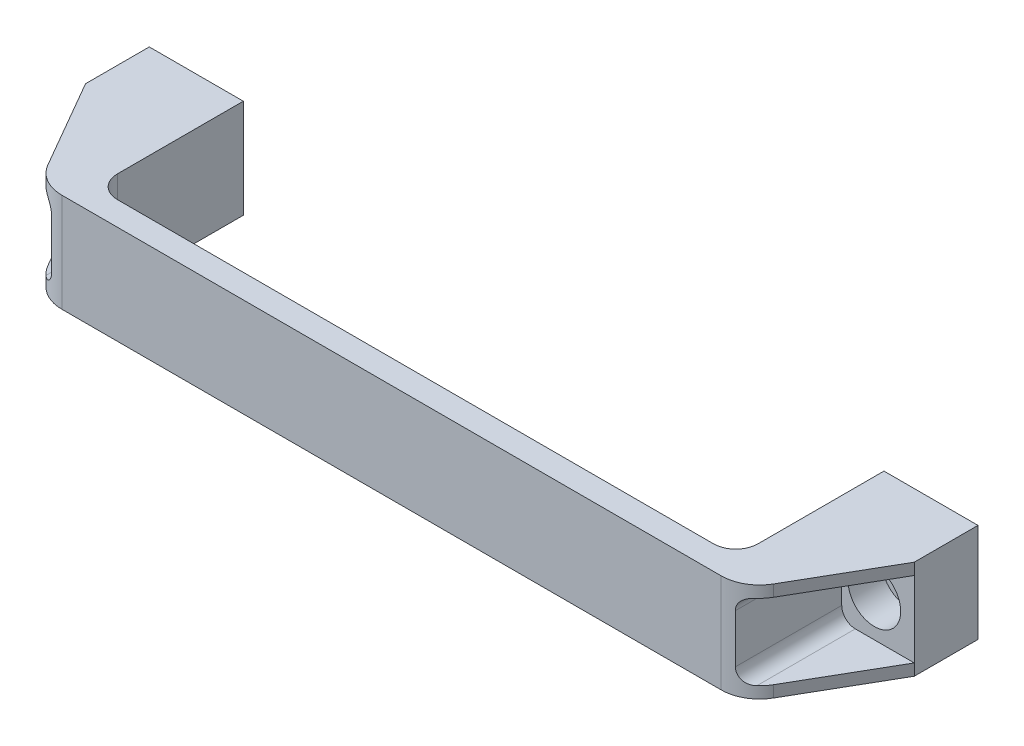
ISO-10303-21;
HEADER;
FILE_DESCRIPTION(('STEP AP214'),'2;1');
FILE_NAME('part.step','',(''),(''),'','','');
FILE_SCHEMA(('AUTOMOTIVE_DESIGN { 1 0 10303 214 1 1 1 1 }'));
ENDSEC;
DATA;
#1=APPLICATION_CONTEXT('core data for automotive mechanical design processes');
#2=APPLICATION_PROTOCOL_DEFINITION('international standard','automotive_design',2000,#1);
#3=PRODUCT_CONTEXT('',#1,'mechanical');
#4=PRODUCT('Part','Part','',(#3));
#5=PRODUCT_RELATED_PRODUCT_CATEGORY('part','',(#4));
#6=PRODUCT_DEFINITION_FORMATION('','',#4);
#7=PRODUCT_DEFINITION_CONTEXT('part definition',#1,'design');
#8=PRODUCT_DEFINITION('design','',#6,#7);
#9=PRODUCT_DEFINITION_SHAPE('','',#8);
#10=(LENGTH_UNIT() NAMED_UNIT(*) SI_UNIT(.MILLI.,.METRE.));
#11=(NAMED_UNIT(*) PLANE_ANGLE_UNIT() SI_UNIT($,.RADIAN.));
#12=(NAMED_UNIT(*) SI_UNIT($,.STERADIAN.) SOLID_ANGLE_UNIT());
#13=UNCERTAINTY_MEASURE_WITH_UNIT(LENGTH_MEASURE(1.E-05),#10,'distance_accuracy_value','');
#14=(GEOMETRIC_REPRESENTATION_CONTEXT(3) GLOBAL_UNCERTAINTY_ASSIGNED_CONTEXT((#13)) GLOBAL_UNIT_ASSIGNED_CONTEXT((#10,
#11,#12)) REPRESENTATION_CONTEXT('',''));
#15=CARTESIAN_POINT('',(0.,0.,0.));
#16=DIRECTION('',(0.,0.,1.));
#17=DIRECTION('',(1.,0.,0.));
#18=AXIS2_PLACEMENT_3D('',#15,#16,#17);
#19=CARTESIAN_POINT('',(0.,6.75,9.5));
#20=DIRECTION('',(0.,0.,-1.));
#21=DIRECTION('',(0.,1.,0.));
#22=AXIS2_PLACEMENT_3D('',#19,#20,#21);
#23=PLANE('',#22);
#24=CARTESIAN_POINT('',(0.,0.,9.5));
#25=DIRECTION('',(0.,0.,-1.));
#26=DIRECTION('',(0.,1.,0.));
#27=AXIS2_PLACEMENT_3D('',#24,#25,#26);
#28=CIRCLE('',#27,5.25);
#29=CARTESIAN_POINT('',(0.,5.25,9.5));
#30=VERTEX_POINT('',#29);
#31=EDGE_CURVE('E430',#30,#30,#28,.T.);
#32=ORIENTED_EDGE('',*,*,#31,.T.);
#33=EDGE_LOOP('',(#32));
#34=FACE_BOUND('',#33,.T.);
#35=CARTESIAN_POINT('',(0.,0.,9.5));
#36=DIRECTION('',(0.,0.,-1.));
#37=DIRECTION('',(0.,1.,0.));
#38=AXIS2_PLACEMENT_3D('',#35,#36,#37);
#39=CIRCLE('',#38,8.25);
#40=CARTESIAN_POINT('',(0.,8.25,9.5));
#41=VERTEX_POINT('',#40);
#42=EDGE_CURVE('E17',#41,#41,#39,.F.);
#43=ORIENTED_EDGE('',*,*,#42,.T.);
#44=EDGE_LOOP('',(#43));
#45=FACE_BOUND('',#44,.T.);
#46=ADVANCED_FACE('F14',(#34,#45),#23,.F.);
#47=CARTESIAN_POINT('',(235.,6.75,9.5));
#48=DIRECTION('',(0.,0.,-1.));
#49=DIRECTION('',(0.,1.,0.));
#50=AXIS2_PLACEMENT_3D('',#47,#48,#49);
#51=PLANE('',#50);
#52=CARTESIAN_POINT('',(235.,0.,9.5));
#53=DIRECTION('',(0.,0.,-1.));
#54=DIRECTION('',(0.,1.,0.));
#55=AXIS2_PLACEMENT_3D('',#52,#53,#54);
#56=CIRCLE('',#55,5.25);
#57=CARTESIAN_POINT('',(235.,5.25,9.5));
#58=VERTEX_POINT('',#57);
#59=EDGE_CURVE('E423',#58,#58,#56,.T.);
#60=ORIENTED_EDGE('',*,*,#59,.T.);
#61=EDGE_LOOP('',(#60));
#62=FACE_BOUND('',#61,.T.);
#63=CARTESIAN_POINT('',(235.,0.,9.5));
#64=DIRECTION('',(0.,0.,-1.));
#65=DIRECTION('',(0.,1.,0.));
#66=AXIS2_PLACEMENT_3D('',#63,#64,#65);
#67=CIRCLE('',#66,8.25);
#68=CARTESIAN_POINT('',(235.,8.25,9.5));
#69=VERTEX_POINT('',#68);
#70=EDGE_CURVE('E432',#69,#69,#67,.F.);
#71=ORIENTED_EDGE('',*,*,#70,.T.);
#72=EDGE_LOOP('',(#71));
#73=FACE_BOUND('',#72,.T.);
#74=ADVANCED_FACE('F443',(#62,#73),#51,.F.);
#75=CARTESIAN_POINT('',(0.,0.,14.75));
#76=DIRECTION('',(0.,0.,-1.));
#77=DIRECTION('',(0.,1.,0.));
#78=AXIS2_PLACEMENT_3D('',#75,#76,#77);
#79=CYLINDRICAL_SURFACE('',#78,8.25);
#80=CARTESIAN_POINT('',(0.,0.,20.));
#81=DIRECTION('',(0.,0.,-1.));
#82=DIRECTION('',(0.,1.,0.));
#83=AXIS2_PLACEMENT_3D('',#80,#81,#82);
#84=CIRCLE('',#83,8.25);
#85=CARTESIAN_POINT('',(0.,8.25,20.));
#86=VERTEX_POINT('',#85);
#87=EDGE_CURVE('E418',#86,#86,#84,.T.);
#88=ORIENTED_EDGE('',*,*,#87,.F.);
#89=EDGE_LOOP('',(#88));
#90=FACE_BOUND('',#89,.T.);
#91=ORIENTED_EDGE('',*,*,#42,.F.);
#92=EDGE_LOOP('',(#91));
#93=FACE_BOUND('',#92,.T.);
#94=ADVANCED_FACE('F440',(#90,#93),#79,.F.);
#95=CARTESIAN_POINT('',(235.,0.,14.75));
#96=DIRECTION('',(0.,0.,-1.));
#97=DIRECTION('',(0.,1.,0.));
#98=AXIS2_PLACEMENT_3D('',#95,#96,#97);
#99=CYLINDRICAL_SURFACE('',#98,8.25);
#100=CARTESIAN_POINT('',(235.,0.,20.));
#101=DIRECTION('',(0.,0.,-1.));
#102=DIRECTION('',(0.,1.,0.));
#103=AXIS2_PLACEMENT_3D('',#100,#101,#102);
#104=CIRCLE('',#103,8.25);
#105=CARTESIAN_POINT('',(235.,8.25,20.));
#106=VERTEX_POINT('',#105);
#107=EDGE_CURVE('E416',#106,#106,#104,.T.);
#108=ORIENTED_EDGE('',*,*,#107,.F.);
#109=EDGE_LOOP('',(#108));
#110=FACE_BOUND('',#109,.T.);
#111=ORIENTED_EDGE('',*,*,#70,.F.);
#112=EDGE_LOOP('',(#111));
#113=FACE_BOUND('',#112,.T.);
#114=ADVANCED_FACE('F442',(#110,#113),#99,.F.);
#115=CARTESIAN_POINT('',(0.,0.,4.75));
#116=DIRECTION('',(0.,0.,-1.));
#117=DIRECTION('',(0.,1.,0.));
#118=AXIS2_PLACEMENT_3D('',#115,#116,#117);
#119=CYLINDRICAL_SURFACE('',#118,5.25);
#120=CARTESIAN_POINT('',(0.,0.,0.));
#121=DIRECTION('',(0.,0.,-1.));
#122=DIRECTION('',(0.,1.,0.));
#123=AXIS2_PLACEMENT_3D('',#120,#121,#122);
#124=CIRCLE('',#123,5.25);
#125=CARTESIAN_POINT('',(0.,5.25,0.));
#126=VERTEX_POINT('',#125);
#127=EDGE_CURVE('E373',#126,#126,#124,.F.);
#128=ORIENTED_EDGE('',*,*,#127,.F.);
#129=EDGE_LOOP('',(#128));
#130=FACE_BOUND('',#129,.T.);
#131=ORIENTED_EDGE('',*,*,#31,.F.);
#132=EDGE_LOOP('',(#131));
#133=FACE_BOUND('',#132,.T.);
#134=ADVANCED_FACE('F450',(#130,#133),#119,.F.);
#135=CARTESIAN_POINT('',(235.,0.,4.75));
#136=DIRECTION('',(0.,0.,-1.));
#137=DIRECTION('',(0.,1.,0.));
#138=AXIS2_PLACEMENT_3D('',#135,#136,#137);
#139=CYLINDRICAL_SURFACE('',#138,5.25);
#140=CARTESIAN_POINT('',(235.,0.,0.));
#141=DIRECTION('',(0.,0.,-1.));
#142=DIRECTION('',(0.,1.,0.));
#143=AXIS2_PLACEMENT_3D('',#140,#141,#142);
#144=CIRCLE('',#143,5.25);
#145=CARTESIAN_POINT('',(235.,5.25,0.));
#146=VERTEX_POINT('',#145);
#147=EDGE_CURVE('E359',#146,#146,#144,.F.);
#148=ORIENTED_EDGE('',*,*,#147,.F.);
#149=EDGE_LOOP('',(#148));
#150=FACE_BOUND('',#149,.T.);
#151=ORIENTED_EDGE('',*,*,#59,.F.);
#152=EDGE_LOOP('',(#151));
#153=FACE_BOUND('',#152,.T.);
#154=ADVANCED_FACE('F458',(#150,#153),#139,.F.);
#155=CARTESIAN_POINT('',(117.5,0.,20.));
#156=DIRECTION('',(0.,0.,1.));
#157=DIRECTION('',(0.,-1.,0.));
#158=AXIS2_PLACEMENT_3D('',#155,#156,#157);
#159=PLANE('',#158);
#160=CARTESIAN_POINT('',(6.,7.625,20.));
#161=DIRECTION('',(0.,0.,-1.));
#162=DIRECTION('',(0.,1.,0.));
#163=AXIS2_PLACEMENT_3D('',#160,#161,#162);
#164=CIRCLE('',#163,4.25);
#165=CARTESIAN_POINT('',(10.25,7.625,20.));
#166=VERTEX_POINT('',#165);
#167=CARTESIAN_POINT('',(6.,11.875,20.));
#168=VERTEX_POINT('',#167);
#169=EDGE_CURVE('E142',#166,#168,#164,.F.);
#170=ORIENTED_EDGE('',*,*,#169,.T.);
#171=DIRECTION('',(-1.,0.,0.));
#172=VECTOR('',#171,1.);
#173=CARTESIAN_POINT('',(-14.5,11.875,20.));
#174=LINE('',#173,#172);
#175=CARTESIAN_POINT('',(-12.5,11.875,20.));
#176=VERTEX_POINT('',#175);
#177=EDGE_CURVE('E146',#168,#176,#174,.T.);
#178=ORIENTED_EDGE('',*,*,#177,.T.);
#179=DIRECTION('',(0.,-1.,0.));
#180=VECTOR('',#179,1.);
#181=CARTESIAN_POINT('',(-12.5,-15.5,20.));
#182=LINE('',#181,#180);
#183=CARTESIAN_POINT('',(-12.5,-11.875,20.));
#184=VERTEX_POINT('',#183);
#185=EDGE_CURVE('E338',#184,#176,#182,.F.);
#186=ORIENTED_EDGE('',*,*,#185,.F.);
#187=DIRECTION('',(1.,0.,0.));
#188=VECTOR('',#187,1.);
#189=CARTESIAN_POINT('',(6.,-11.875,20.));
#190=LINE('',#189,#188);
#191=CARTESIAN_POINT('',(6.,-11.875,20.));
#192=VERTEX_POINT('',#191);
#193=EDGE_CURVE('E415',#184,#192,#190,.T.);
#194=ORIENTED_EDGE('',*,*,#193,.T.);
#195=CARTESIAN_POINT('',(6.,-7.625,20.));
#196=DIRECTION('',(0.,0.,-1.));
#197=DIRECTION('',(0.,1.,0.));
#198=AXIS2_PLACEMENT_3D('',#195,#196,#197);
#199=CIRCLE('',#198,4.25);
#200=CARTESIAN_POINT('',(10.25,-7.625,20.));
#201=VERTEX_POINT('',#200);
#202=EDGE_CURVE('E380',#192,#201,#199,.F.);
#203=ORIENTED_EDGE('',*,*,#202,.T.);
#204=DIRECTION('',(0.,1.,0.));
#205=VECTOR('',#204,1.);
#206=CARTESIAN_POINT('',(10.25,7.625,20.));
#207=LINE('',#206,#205);
#208=EDGE_CURVE('E138',#201,#166,#207,.T.);
#209=ORIENTED_EDGE('',*,*,#208,.T.);
#210=EDGE_LOOP('',(#170,#178,#186,#194,#203,#209));
#211=FACE_BOUND('',#210,.T.);
#212=ORIENTED_EDGE('',*,*,#87,.T.);
#213=EDGE_LOOP('',(#212));
#214=FACE_BOUND('',#213,.T.);
#215=ADVANCED_FACE('F462',(#211,#214),#159,.T.);
#216=CARTESIAN_POINT('',(117.5,0.,20.));
#217=DIRECTION('',(0.,0.,1.));
#218=DIRECTION('',(0.,-1.,0.));
#219=AXIS2_PLACEMENT_3D('',#216,#217,#218);
#220=PLANE('',#219);
#221=CARTESIAN_POINT('',(229.,-7.625,20.));
#222=DIRECTION('',(0.,0.,-1.));
#223=DIRECTION('',(0.,1.,0.));
#224=AXIS2_PLACEMENT_3D('',#221,#222,#223);
#225=CIRCLE('',#224,4.25);
#226=CARTESIAN_POINT('',(224.75,-7.625,20.));
#227=VERTEX_POINT('',#226);
#228=CARTESIAN_POINT('',(229.,-11.875,20.));
#229=VERTEX_POINT('',#228);
#230=EDGE_CURVE('E180',#227,#229,#225,.F.);
#231=ORIENTED_EDGE('',*,*,#230,.T.);
#232=DIRECTION('',(1.,0.,0.));
#233=VECTOR('',#232,1.);
#234=CARTESIAN_POINT('',(249.5,-11.875,20.));
#235=LINE('',#234,#233);
#236=CARTESIAN_POINT('',(247.5,-11.875,20.));
#237=VERTEX_POINT('',#236);
#238=EDGE_CURVE('E176',#229,#237,#235,.T.);
#239=ORIENTED_EDGE('',*,*,#238,.T.);
#240=DIRECTION('',(0.,1.,0.));
#241=VECTOR('',#240,1.);
#242=CARTESIAN_POINT('',(247.5,-15.5,20.));
#243=LINE('',#242,#241);
#244=CARTESIAN_POINT('',(247.5,11.875,20.));
#245=VERTEX_POINT('',#244);
#246=EDGE_CURVE('E353',#245,#237,#243,.F.);
#247=ORIENTED_EDGE('',*,*,#246,.F.);
#248=DIRECTION('',(-1.,0.,0.));
#249=VECTOR('',#248,1.);
#250=CARTESIAN_POINT('',(229.,11.875,20.));
#251=LINE('',#250,#249);
#252=CARTESIAN_POINT('',(229.,11.875,20.));
#253=VERTEX_POINT('',#252);
#254=EDGE_CURVE('E332',#245,#253,#251,.T.);
#255=ORIENTED_EDGE('',*,*,#254,.T.);
#256=CARTESIAN_POINT('',(229.,7.625,20.));
#257=DIRECTION('',(0.,0.,-1.));
#258=DIRECTION('',(0.,1.,0.));
#259=AXIS2_PLACEMENT_3D('',#256,#257,#258);
#260=CIRCLE('',#259,4.25);
#261=CARTESIAN_POINT('',(224.75,7.625,20.));
#262=VERTEX_POINT('',#261);
#263=EDGE_CURVE('E320',#253,#262,#260,.F.);
#264=ORIENTED_EDGE('',*,*,#263,.T.);
#265=DIRECTION('',(0.,-1.,0.));
#266=VECTOR('',#265,1.);
#267=CARTESIAN_POINT('',(224.75,-7.625,20.));
#268=LINE('',#267,#266);
#269=EDGE_CURVE('E179',#262,#227,#268,.T.);
#270=ORIENTED_EDGE('',*,*,#269,.T.);
#271=EDGE_LOOP('',(#231,#239,#247,#255,#264,#270));
#272=FACE_BOUND('',#271,.T.);
#273=ORIENTED_EDGE('',*,*,#107,.T.);
#274=EDGE_LOOP('',(#273));
#275=FACE_BOUND('',#274,.T.);
#276=ADVANCED_FACE('F466',(#272,#275),#220,.T.);
#277=CARTESIAN_POINT('',(6.,-11.875,20.));
#278=DIRECTION('',(0.,-1.,0.));
#279=DIRECTION('',(1.,0.,0.));
#280=AXIS2_PLACEMENT_3D('',#277,#278,#279);
#281=PLANE('',#280);
#282=DIRECTION('',(0.,0.,-1.));
#283=VECTOR('',#282,1.);
#284=CARTESIAN_POINT('',(6.,-11.875,20.));
#285=LINE('',#284,#283);
#286=CARTESIAN_POINT('',(6.,-11.875,50.8919528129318));
#287=VERTEX_POINT('',#286);
#288=EDGE_CURVE('E381',#287,#192,#285,.T.);
#289=ORIENTED_EDGE('',*,*,#288,.T.);
#290=ORIENTED_EDGE('',*,*,#193,.F.);
#291=DIRECTION('',(-0.5,0.,-0.866025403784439));
#292=VECTOR('',#291,1.);
#293=CARTESIAN_POINT('',(3.66580753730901,-11.875,48.));
#294=LINE('',#293,#292);
#295=CARTESIAN_POINT('',(3.66580753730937,-11.875,48.));
#296=VERTEX_POINT('',#295);
#297=EDGE_CURVE('E352',#296,#184,#294,.T.);
#298=ORIENTED_EDGE('',*,*,#297,.F.);
#299=CARTESIAN_POINT('',(14.058112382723,-11.875,42.));
#300=DIRECTION('',(0.,-1.,0.));
#301=DIRECTION('',(1.,0.,0.));
#302=AXIS2_PLACEMENT_3D('',#299,#300,#301);
#303=CIRCLE('',#302,12.);
#304=EDGE_CURVE('E301',#287,#296,#303,.T.);
#305=ORIENTED_EDGE('',*,*,#304,.F.);
#306=EDGE_LOOP('',(#289,#290,#298,#305));
#307=FACE_BOUND('',#306,.T.);
#308=ADVANCED_FACE('F469',(#307),#281,.F.);
#309=CARTESIAN_POINT('',(3.66580753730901,-15.5,48.));
#310=DIRECTION('',(-0.866025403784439,0.,0.5));
#311=DIRECTION('',(-0.5,0.,-0.866025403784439));
#312=AXIS2_PLACEMENT_3D('',#309,#310,#311);
#313=PLANE('',#312);
#314=DIRECTION('',(-0.499999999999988,0.,-0.866025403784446));
#315=VECTOR('',#314,1.);
#316=CARTESIAN_POINT('',(3.66580753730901,15.5,48.));
#317=LINE('',#316,#315);
#318=CARTESIAN_POINT('',(3.66580753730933,15.5,48.));
#319=VERTEX_POINT('',#318);
#320=CARTESIAN_POINT('',(-12.5,15.5,20.));
#321=VERTEX_POINT('',#320);
#322=EDGE_CURVE('E303',#319,#321,#317,.T.);
#323=ORIENTED_EDGE('',*,*,#322,.T.);
#324=DIRECTION('',(0.,-1.,0.));
#325=VECTOR('',#324,1.);
#326=CARTESIAN_POINT('',(-12.5,-15.5,20.));
#327=LINE('',#326,#325);
#328=EDGE_CURVE('E400',#176,#321,#327,.F.);
#329=ORIENTED_EDGE('',*,*,#328,.F.);
#330=DIRECTION('',(0.499999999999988,0.,0.866025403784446));
#331=VECTOR('',#330,1.);
#332=CARTESIAN_POINT('',(-12.5,11.875,20.));
#333=LINE('',#332,#331);
#334=CARTESIAN_POINT('',(3.66580753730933,11.875,48.));
#335=VERTEX_POINT('',#334);
#336=EDGE_CURVE('E388',#176,#335,#333,.T.);
#337=ORIENTED_EDGE('',*,*,#336,.T.);
#338=DIRECTION('',(0.,-1.,0.));
#339=VECTOR('',#338,1.);
#340=CARTESIAN_POINT('',(3.66580753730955,-15.5,48.));
#341=LINE('',#340,#339);
#342=EDGE_CURVE('E390',#319,#335,#341,.T.);
#343=ORIENTED_EDGE('',*,*,#342,.F.);
#344=EDGE_LOOP('',(#323,#329,#337,#343));
#345=FACE_BOUND('',#344,.T.);
#346=ADVANCED_FACE('F473',(#345),#313,.T.);
#347=CARTESIAN_POINT('',(-14.5,11.875,20.));
#348=DIRECTION('',(0.,1.,0.));
#349=DIRECTION('',(-1.,0.,0.));
#350=AXIS2_PLACEMENT_3D('',#347,#348,#349);
#351=PLANE('',#350);
#352=ORIENTED_EDGE('',*,*,#177,.F.);
#353=DIRECTION('',(0.,0.,-1.));
#354=VECTOR('',#353,1.);
#355=CARTESIAN_POINT('',(6.,11.875,20.));
#356=LINE('',#355,#354);
#357=CARTESIAN_POINT('',(6.,11.875,50.8919528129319));
#358=VERTEX_POINT('',#357);
#359=EDGE_CURVE('E386',#168,#358,#356,.F.);
#360=ORIENTED_EDGE('',*,*,#359,.T.);
#361=CARTESIAN_POINT('',(14.058112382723,11.875,42.));
#362=DIRECTION('',(0.,-1.,0.));
#363=DIRECTION('',(1.,0.,0.));
#364=AXIS2_PLACEMENT_3D('',#361,#362,#363);
#365=CIRCLE('',#364,12.);
#366=EDGE_CURVE('E393',#335,#358,#365,.F.);
#367=ORIENTED_EDGE('',*,*,#366,.F.);
#368=ORIENTED_EDGE('',*,*,#336,.F.);
#369=EDGE_LOOP('',(#352,#360,#367,#368));
#370=FACE_BOUND('',#369,.T.);
#371=ADVANCED_FACE('F477',(#370),#351,.F.);
#372=CARTESIAN_POINT('',(6.,7.625,20.));
#373=DIRECTION('',(0.,0.,-1.));
#374=DIRECTION('',(0.,1.,0.));
#375=AXIS2_PLACEMENT_3D('',#372,#373,#374);
#376=CYLINDRICAL_SURFACE('',#375,4.25);
#377=ORIENTED_EDGE('',*,*,#359,.F.);
#378=ORIENTED_EDGE('',*,*,#169,.F.);
#379=DIRECTION('',(0.,0.,1.));
#380=VECTOR('',#379,1.);
#381=CARTESIAN_POINT('',(10.25,7.625,20.));
#382=LINE('',#381,#380);
#383=CARTESIAN_POINT('',(10.25,7.625,53.3797311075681));
#384=VERTEX_POINT('',#383);
#385=EDGE_CURVE('E384',#166,#384,#382,.T.);
#386=ORIENTED_EDGE('',*,*,#385,.T.);
#387=CARTESIAN_POINT('',(6.00000000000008,11.875,50.8919528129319));
#388=CARTESIAN_POINT('',(6.13384738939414,11.8750073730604,51.0133113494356));
#389=CARTESIAN_POINT('',(6.27059676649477,11.8686731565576,51.1316698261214));
#390=CARTESIAN_POINT('',(6.54878581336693,11.8417412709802,51.3617511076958));
#391=CARTESIAN_POINT('',(6.69023670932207,11.8211067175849,51.4734559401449));
#392=CARTESIAN_POINT('',(6.97658654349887,11.7638618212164,51.6893934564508));
#393=CARTESIAN_POINT('',(7.12149714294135,11.72718699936,51.793593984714));
#394=CARTESIAN_POINT('',(7.41192284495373,11.636491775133,51.992952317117));
#395=CARTESIAN_POINT('',(7.55743696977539,11.5824930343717,52.0881212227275));
#396=CARTESIAN_POINT('',(7.79995949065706,11.4765054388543,52.2395758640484));
#397=CARTESIAN_POINT('',(7.89749898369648,11.429468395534,52.2985143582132));
#398=CARTESIAN_POINT('',(8.09075045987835,11.3267867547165,52.4116815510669));
#399=CARTESIAN_POINT('',(8.18646289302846,11.271144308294,52.4659114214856));
#400=CARTESIAN_POINT('',(8.3748018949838,11.1513631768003,52.5693660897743));
#401=CARTESIAN_POINT('',(8.46743617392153,11.0872480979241,52.6186041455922));
#402=CARTESIAN_POINT('',(8.64880410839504,10.9505413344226,52.7121328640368));
#403=CARTESIAN_POINT('',(8.73753947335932,10.8779534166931,52.7564257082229));
#404=CARTESIAN_POINT('',(8.91053657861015,10.7241515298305,52.8402838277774));
#405=CARTESIAN_POINT('',(8.99477309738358,10.6428953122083,52.8798237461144));
#406=CARTESIAN_POINT('',(9.15720204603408,10.4725289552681,52.9539512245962));
#407=CARTESIAN_POINT('',(9.23539682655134,10.3834218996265,52.9885407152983));
#408=CARTESIAN_POINT('',(9.38488711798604,10.1977918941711,53.0529453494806));
#409=CARTESIAN_POINT('',(9.45617411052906,10.1012600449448,53.0827546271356));
#410=CARTESIAN_POINT('',(9.59084163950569,9.90158847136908,53.1377189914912));
#411=CARTESIAN_POINT('',(9.65422275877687,9.79844923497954,53.1628744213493));
#412=CARTESIAN_POINT('',(9.76840793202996,9.59336402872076,53.2072270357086));
#413=CARTESIAN_POINT('',(9.81976536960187,9.49178677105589,53.2267075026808));
#414=CARTESIAN_POINT('',(9.91435934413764,9.28430382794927,53.2619651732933));
#415=CARTESIAN_POINT('',(9.95759625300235,9.17839834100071,53.2777425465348));
#416=CARTESIAN_POINT('',(10.0354674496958,8.96312939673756,53.3057526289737));
#417=CARTESIAN_POINT('',(10.0701097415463,8.85376926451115,53.3179886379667));
#418=CARTESIAN_POINT('',(10.1304890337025,8.6323389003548,53.3390823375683));
#419=CARTESIAN_POINT('',(10.1562286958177,8.52026948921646,53.3479410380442));
#420=CARTESIAN_POINT('',(10.2015095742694,8.27842770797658,53.3634197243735));
#421=CARTESIAN_POINT('',(10.2196855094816,8.14836636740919,53.3695551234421));
#422=CARTESIAN_POINT('',(10.2439357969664,7.88719980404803,53.3777009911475));
#423=CARTESIAN_POINT('',(10.2500291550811,7.75609654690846,53.3797179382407));
#424=CARTESIAN_POINT('',(10.25,7.625,53.379731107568));
#425=B_SPLINE_CURVE_WITH_KNOTS('',3,(#387,#388,#389,#390,#391,#392,#393,#394,#395,#396,#397,
#398,#399,#400,#401,#402,#403,#404,#405,#406,#407,#408,#409,#410,#411,#412,#413,#414,#415,#416,
#417,#418,#419,#420,#421,#422,#423,#424),.UNSPECIFIED.,.F.,.F.,(4,2,2,2,2,2,2,2,2,2,2,2,2,2,2,2,
2,2,4),(0.,0.54206845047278,1.08554026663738,1.6312171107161,2.17621428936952,2.5457192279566,
2.91513195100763,3.28353631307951,3.65177750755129,4.02190344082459,4.39188463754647,
4.76231642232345,5.13272088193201,5.47873258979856,5.82472844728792,6.17040086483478,
6.51596983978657,6.90973787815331,7.30288602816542),.UNSPECIFIED.);
#426=EDGE_CURVE('E238',#358,#384,#425,.T.);
#427=ORIENTED_EDGE('',*,*,#426,.F.);
#428=EDGE_LOOP('',(#377,#378,#386,#427));
#429=FACE_BOUND('',#428,.T.);
#430=ADVANCED_FACE('F480',(#429),#376,.F.);
#431=CARTESIAN_POINT('',(10.25,7.625,20.));
#432=DIRECTION('',(1.,0.,0.));
#433=DIRECTION('',(0.,1.,0.));
#434=AXIS2_PLACEMENT_3D('',#431,#432,#433);
#435=PLANE('',#434);
#436=ORIENTED_EDGE('',*,*,#385,.F.);
#437=ORIENTED_EDGE('',*,*,#208,.F.);
#438=DIRECTION('',(0.,0.,-1.));
#439=VECTOR('',#438,1.);
#440=CARTESIAN_POINT('',(10.25,-7.625,20.));
#441=LINE('',#440,#439);
#442=CARTESIAN_POINT('',(10.25,-7.625,53.3797311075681));
#443=VERTEX_POINT('',#442);
#444=EDGE_CURVE('E378',#201,#443,#441,.F.);
#445=ORIENTED_EDGE('',*,*,#444,.T.);
#446=DIRECTION('',(0.,-1.,0.));
#447=VECTOR('',#446,1.);
#448=CARTESIAN_POINT('',(10.25,-15.5,53.3797311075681));
#449=LINE('',#448,#447);
#450=EDGE_CURVE('E237',#384,#443,#449,.T.);
#451=ORIENTED_EDGE('',*,*,#450,.F.);
#452=EDGE_LOOP('',(#436,#437,#445,#451));
#453=FACE_BOUND('',#452,.T.);
#454=ADVANCED_FACE('F484',(#453),#435,.F.);
#455=CARTESIAN_POINT('',(6.,-7.625,20.));
#456=DIRECTION('',(0.,0.,-1.));
#457=DIRECTION('',(0.,1.,0.));
#458=AXIS2_PLACEMENT_3D('',#455,#456,#457);
#459=CYLINDRICAL_SURFACE('',#458,4.25);
#460=ORIENTED_EDGE('',*,*,#444,.F.);
#461=ORIENTED_EDGE('',*,*,#202,.F.);
#462=ORIENTED_EDGE('',*,*,#288,.F.);
#463=CARTESIAN_POINT('',(10.25,-7.625,53.379731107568));
#464=CARTESIAN_POINT('',(10.2500152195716,-7.73839038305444,53.3797234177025));
#465=CARTESIAN_POINT('',(10.2454627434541,-7.85177923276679,53.3782123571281));
#466=CARTESIAN_POINT('',(10.2273317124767,-8.07774568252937,53.3721277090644));
#467=CARTESIAN_POINT('',(10.2137535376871,-8.19032331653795,53.367554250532));
#468=CARTESIAN_POINT('',(10.1776958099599,-8.41377337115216,53.3552942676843));
#469=CARTESIAN_POINT('',(10.1552238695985,-8.52464716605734,53.3476104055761));
#470=CARTESIAN_POINT('',(10.101596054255,-8.74399711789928,53.3290241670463));
#471=CARTESIAN_POINT('',(10.0704403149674,-8.85247331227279,53.3181218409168));
#472=CARTESIAN_POINT('',(9.99972993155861,-9.06630022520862,53.2929596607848));
#473=CARTESIAN_POINT('',(9.9601720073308,-9.17164970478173,53.2786984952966));
#474=CARTESIAN_POINT('',(9.87303929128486,-9.37847161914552,53.2466580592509));
#475=CARTESIAN_POINT('',(9.8254615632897,-9.47994261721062,53.2288774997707));
#476=CARTESIAN_POINT('',(9.72281679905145,-9.6781891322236,53.1896481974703));
#477=CARTESIAN_POINT('',(9.66775505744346,-9.77496790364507,53.1682020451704));
#478=CARTESIAN_POINT('',(9.5506638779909,-9.96328655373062,53.1214603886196));
#479=CARTESIAN_POINT('',(9.48863188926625,-10.0548244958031,53.0961634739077));
#480=CARTESIAN_POINT('',(9.35821385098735,-10.2321094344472,53.0415557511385));
#481=CARTESIAN_POINT('',(9.28982250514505,-10.3178514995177,53.0122415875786));
#482=CARTESIAN_POINT('',(9.14743093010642,-10.4829834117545,52.949486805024));
#483=CARTESIAN_POINT('',(9.07342868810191,-10.5623709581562,52.916044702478));
#484=CARTESIAN_POINT('',(8.92064291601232,-10.7143284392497,52.8449758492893));
#485=CARTESIAN_POINT('',(8.84186075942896,-10.7869003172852,52.8073502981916));
#486=CARTESIAN_POINT('',(8.68028912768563,-10.9249771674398,52.7278668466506));
#487=CARTESIAN_POINT('',(8.59749816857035,-10.9904794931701,52.6860073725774));
#488=CARTESIAN_POINT('',(8.42639249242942,-11.1159431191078,52.59685264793));
#489=CARTESIAN_POINT('',(8.3379879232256,-11.1756969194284,52.5494376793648));
#490=CARTESIAN_POINT('',(8.1587339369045,-11.2874502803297,52.4502564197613));
#491=CARTESIAN_POINT('',(8.06788363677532,-11.3394469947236,52.3984885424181));
#492=CARTESIAN_POINT('',(7.79296333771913,-11.4838273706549,52.2368406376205));
#493=CARTESIAN_POINT('',(7.60644498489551,-11.5646580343,52.1205758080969));
#494=CARTESIAN_POINT('',(7.21470690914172,-11.7035408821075,51.8604540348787));
#495=CARTESIAN_POINT('',(7.00948224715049,-11.7585068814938,51.7150005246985));
#496=CARTESIAN_POINT('',(6.60509436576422,-11.8367398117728,51.4083412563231));
#497=CARTESIAN_POINT('',(6.40592825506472,-11.8600221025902,51.2471431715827));
#498=CARTESIAN_POINT('',(6.17628204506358,-11.8714933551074,51.0487015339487));
#499=CARTESIAN_POINT('',(6.14074838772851,-11.8728162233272,51.0176264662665));
#500=CARTESIAN_POINT('',(6.07008379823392,-11.8745686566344,50.9550886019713));
#501=CARTESIAN_POINT('',(6.03495240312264,-11.8749993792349,50.9236263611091));
#502=CARTESIAN_POINT('',(6.00000000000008,-11.875,50.8919528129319));
#503=B_SPLINE_CURVE_WITH_KNOTS('',3,(#463,#464,#465,#466,#467,#468,#469,#470,#471,#472,#473,
#474,#475,#476,#477,#478,#479,#480,#481,#482,#483,#484,#485,#486,#487,#488,#489,#490,#491,#492,
#493,#494,#495,#496,#497,#498,#499,#500,#501,#502),.UNSPECIFIED.,.F.,.F.,(4,2,2,2,2,2,2,2,2,2,2,
2,2,2,2,2,2,2,2,4),(0.,0.340067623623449,0.680120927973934,1.01988379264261,1.35964134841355,
1.699531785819,2.0395469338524,2.37932277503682,2.71922337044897,3.05940962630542,
3.39971850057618,3.73993004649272,4.0802685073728,4.43017327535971,4.78020611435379,
5.47995915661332,6.24968804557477,7.01904364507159,7.16071198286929,7.30219639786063),.UNSPECIFIED.);
#504=EDGE_CURVE('E227',#443,#287,#503,.T.);
#505=ORIENTED_EDGE('',*,*,#504,.F.);
#506=EDGE_LOOP('',(#460,#461,#462,#505));
#507=FACE_BOUND('',#506,.T.);
#508=ADVANCED_FACE('F245',(#507),#459,.F.);
#509=CARTESIAN_POINT('',(-12.5,-15.5,0.));
#510=DIRECTION('',(0.,0.,-1.));
#511=DIRECTION('',(0.,1.,0.));
#512=AXIS2_PLACEMENT_3D('',#509,#510,#511);
#513=PLANE('',#512);
#514=DIRECTION('',(1.,0.,0.));
#515=VECTOR('',#514,1.);
#516=CARTESIAN_POINT('',(117.5,-15.5,0.));
#517=LINE('',#516,#515);
#518=CARTESIAN_POINT('',(-12.5,-15.5,0.));
#519=VERTEX_POINT('',#518);
#520=CARTESIAN_POINT('',(17.,-15.5,0.));
#521=VERTEX_POINT('',#520);
#522=EDGE_CURVE('E236',#519,#521,#517,.T.);
#523=ORIENTED_EDGE('',*,*,#522,.F.);
#524=DIRECTION('',(0.,-1.,0.));
#525=VECTOR('',#524,1.);
#526=CARTESIAN_POINT('',(-12.5,-15.5,0.));
#527=LINE('',#526,#525);
#528=CARTESIAN_POINT('',(-12.5,15.5,0.));
#529=VERTEX_POINT('',#528);
#530=EDGE_CURVE('E339',#529,#519,#527,.T.);
#531=ORIENTED_EDGE('',*,*,#530,.F.);
#532=DIRECTION('',(1.,0.,0.));
#533=VECTOR('',#532,1.);
#534=CARTESIAN_POINT('',(117.5,15.5,0.));
#535=LINE('',#534,#533);
#536=CARTESIAN_POINT('',(17.,15.5,0.));
#537=VERTEX_POINT('',#536);
#538=EDGE_CURVE('E302',#529,#537,#535,.T.);
#539=ORIENTED_EDGE('',*,*,#538,.T.);
#540=DIRECTION('',(0.,1.,0.));
#541=VECTOR('',#540,1.);
#542=CARTESIAN_POINT('',(17.,-15.5,0.));
#543=LINE('',#542,#541);
#544=EDGE_CURVE('E370',#521,#537,#543,.T.);
#545=ORIENTED_EDGE('',*,*,#544,.F.);
#546=EDGE_LOOP('',(#523,#531,#539,#545));
#547=FACE_BOUND('',#546,.T.);
#548=ORIENTED_EDGE('',*,*,#127,.T.);
#549=EDGE_LOOP('',(#548));
#550=FACE_BOUND('',#549,.T.);
#551=ADVANCED_FACE('F491',(#547,#550),#513,.T.);
#552=CARTESIAN_POINT('',(17.,-15.5,0.));
#553=DIRECTION('',(1.,0.,0.));
#554=DIRECTION('',(0.,1.,0.));
#555=AXIS2_PLACEMENT_3D('',#552,#553,#554);
#556=PLANE('',#555);
#557=DIRECTION('',(0.,0.,1.));
#558=VECTOR('',#557,1.);
#559=CARTESIAN_POINT('',(17.,-15.5,0.));
#560=LINE('',#559,#558);
#561=CARTESIAN_POINT('',(17.,-15.5,39.5));
#562=VERTEX_POINT('',#561);
#563=EDGE_CURVE('E226',#521,#562,#560,.T.);
#564=ORIENTED_EDGE('',*,*,#563,.F.);
#565=ORIENTED_EDGE('',*,*,#544,.T.);
#566=DIRECTION('',(0.,0.,1.));
#567=VECTOR('',#566,1.);
#568=CARTESIAN_POINT('',(17.,15.5,0.));
#569=LINE('',#568,#567);
#570=CARTESIAN_POINT('',(17.,15.5,39.5));
#571=VERTEX_POINT('',#570);
#572=EDGE_CURVE('E298',#537,#571,#569,.T.);
#573=ORIENTED_EDGE('',*,*,#572,.T.);
#574=DIRECTION('',(0.,-1.,0.));
#575=VECTOR('',#574,1.);
#576=CARTESIAN_POINT('',(17.,-15.5,39.5));
#577=LINE('',#576,#575);
#578=EDGE_CURVE('E368',#571,#562,#577,.T.);
#579=ORIENTED_EDGE('',*,*,#578,.T.);
#580=EDGE_LOOP('',(#564,#565,#573,#579));
#581=FACE_BOUND('',#580,.T.);
#582=ADVANCED_FACE('F523',(#581),#556,.T.);
#583=CARTESIAN_POINT('',(24.,-15.5,39.5));
#584=DIRECTION('',(0.,-1.,0.));
#585=DIRECTION('',(1.,0.,0.));
#586=AXIS2_PLACEMENT_3D('',#583,#584,#585);
#587=CYLINDRICAL_SURFACE('',#586,7.);
#588=DIRECTION('',(0.,1.,0.));
#589=VECTOR('',#588,1.);
#590=CARTESIAN_POINT('',(24.,-15.5,46.5));
#591=LINE('',#590,#589);
#592=CARTESIAN_POINT('',(24.,-15.5,46.5));
#593=VERTEX_POINT('',#592);
#594=CARTESIAN_POINT('',(24.,15.5,46.5));
#595=VERTEX_POINT('',#594);
#596=EDGE_CURVE('E365',#593,#595,#591,.T.);
#597=ORIENTED_EDGE('',*,*,#596,.F.);
#598=CARTESIAN_POINT('',(24.,-15.5,39.5));
#599=DIRECTION('',(0.,-1.,0.));
#600=DIRECTION('',(1.,0.,0.));
#601=AXIS2_PLACEMENT_3D('',#598,#599,#600);
#602=CIRCLE('',#601,7.);
#603=EDGE_CURVE('E223',#562,#593,#602,.F.);
#604=ORIENTED_EDGE('',*,*,#603,.F.);
#605=ORIENTED_EDGE('',*,*,#578,.F.);
#606=CARTESIAN_POINT('',(24.,15.5,39.5));
#607=DIRECTION('',(0.,-1.,0.));
#608=DIRECTION('',(1.,0.,0.));
#609=AXIS2_PLACEMENT_3D('',#606,#607,#608);
#610=CIRCLE('',#609,7.);
#611=EDGE_CURVE('E317',#571,#595,#610,.F.);
#612=ORIENTED_EDGE('',*,*,#611,.T.);
#613=EDGE_LOOP('',(#597,#604,#605,#612));
#614=FACE_BOUND('',#613,.T.);
#615=ADVANCED_FACE('F596',(#614),#587,.F.);
#616=CARTESIAN_POINT('',(24.,-15.5,46.5));
#617=DIRECTION('',(0.,0.,-1.));
#618=DIRECTION('',(0.,1.,0.));
#619=AXIS2_PLACEMENT_3D('',#616,#617,#618);
#620=PLANE('',#619);
#621=DIRECTION('',(1.,0.,0.));
#622=VECTOR('',#621,1.);
#623=CARTESIAN_POINT('',(117.5,-15.5,46.5));
#624=LINE('',#623,#622);
#625=CARTESIAN_POINT('',(211.,-15.5,46.5));
#626=VERTEX_POINT('',#625);
#627=EDGE_CURVE('E222',#593,#626,#624,.T.);
#628=ORIENTED_EDGE('',*,*,#627,.F.);
#629=ORIENTED_EDGE('',*,*,#596,.T.);
#630=DIRECTION('',(1.,0.,0.));
#631=VECTOR('',#630,1.);
#632=CARTESIAN_POINT('',(117.5,15.5,46.5));
#633=LINE('',#632,#631);
#634=CARTESIAN_POINT('',(211.,15.5,46.5));
#635=VERTEX_POINT('',#634);
#636=EDGE_CURVE('E315',#595,#635,#633,.T.);
#637=ORIENTED_EDGE('',*,*,#636,.T.);
#638=DIRECTION('',(0.,-1.,0.));
#639=VECTOR('',#638,1.);
#640=CARTESIAN_POINT('',(211.,-15.5,46.5));
#641=LINE('',#640,#639);
#642=EDGE_CURVE('E363',#635,#626,#641,.T.);
#643=ORIENTED_EDGE('',*,*,#642,.T.);
#644=EDGE_LOOP('',(#628,#629,#637,#643));
#645=FACE_BOUND('',#644,.T.);
#646=ADVANCED_FACE('F544',(#645),#620,.T.);
#647=CARTESIAN_POINT('',(211.,-15.5,39.5));
#648=DIRECTION('',(0.,-1.,0.));
#649=DIRECTION('',(1.,0.,0.));
#650=AXIS2_PLACEMENT_3D('',#647,#648,#649);
#651=CYLINDRICAL_SURFACE('',#650,7.);
#652=DIRECTION('',(0.,-1.,0.));
#653=VECTOR('',#652,1.);
#654=CARTESIAN_POINT('',(218.,-15.5,39.5));
#655=LINE('',#654,#653);
#656=CARTESIAN_POINT('',(218.,-15.5,39.5));
#657=VERTEX_POINT('',#656);
#658=CARTESIAN_POINT('',(218.,15.5,39.5));
#659=VERTEX_POINT('',#658);
#660=EDGE_CURVE('E360',#657,#659,#655,.F.);
#661=ORIENTED_EDGE('',*,*,#660,.F.);
#662=CARTESIAN_POINT('',(211.,-15.5,39.5));
#663=DIRECTION('',(0.,-1.,0.));
#664=DIRECTION('',(1.,0.,0.));
#665=AXIS2_PLACEMENT_3D('',#662,#663,#664);
#666=CIRCLE('',#665,7.);
#667=EDGE_CURVE('E218',#626,#657,#666,.F.);
#668=ORIENTED_EDGE('',*,*,#667,.F.);
#669=ORIENTED_EDGE('',*,*,#642,.F.);
#670=CARTESIAN_POINT('',(211.,15.5,39.5));
#671=DIRECTION('',(0.,-1.,0.));
#672=DIRECTION('',(1.,0.,0.));
#673=AXIS2_PLACEMENT_3D('',#670,#671,#672);
#674=CIRCLE('',#673,7.);
#675=EDGE_CURVE('E314',#635,#659,#674,.F.);
#676=ORIENTED_EDGE('',*,*,#675,.T.);
#677=EDGE_LOOP('',(#661,#668,#669,#676));
#678=FACE_BOUND('',#677,.T.);
#679=ADVANCED_FACE('F549',(#678),#651,.F.);
#680=CARTESIAN_POINT('',(218.,-15.5,39.5));
#681=DIRECTION('',(-1.,0.,0.));
#682=DIRECTION('',(0.,-1.,0.));
#683=AXIS2_PLACEMENT_3D('',#680,#681,#682);
#684=PLANE('',#683);
#685=DIRECTION('',(0.,0.,1.));
#686=VECTOR('',#685,1.);
#687=CARTESIAN_POINT('',(218.,-15.5,0.));
#688=LINE('',#687,#686);
#689=CARTESIAN_POINT('',(218.,-15.5,0.));
#690=VERTEX_POINT('',#689);
#691=EDGE_CURVE('E221',#657,#690,#688,.F.);
#692=ORIENTED_EDGE('',*,*,#691,.F.);
#693=ORIENTED_EDGE('',*,*,#660,.T.);
#694=DIRECTION('',(0.,0.,1.));
#695=VECTOR('',#694,1.);
#696=CARTESIAN_POINT('',(218.,15.5,0.));
#697=LINE('',#696,#695);
#698=CARTESIAN_POINT('',(218.,15.5,0.));
#699=VERTEX_POINT('',#698);
#700=EDGE_CURVE('E310',#659,#699,#697,.F.);
#701=ORIENTED_EDGE('',*,*,#700,.T.);
#702=DIRECTION('',(0.,1.,0.));
#703=VECTOR('',#702,1.);
#704=CARTESIAN_POINT('',(218.,-15.5,0.));
#705=LINE('',#704,#703);
#706=EDGE_CURVE('E356',#690,#699,#705,.T.);
#707=ORIENTED_EDGE('',*,*,#706,.F.);
#708=EDGE_LOOP('',(#692,#693,#701,#707));
#709=FACE_BOUND('',#708,.T.);
#710=ADVANCED_FACE('F554',(#709),#684,.T.);
#711=CARTESIAN_POINT('',(218.,-15.5,0.));
#712=DIRECTION('',(0.,0.,-1.));
#713=DIRECTION('',(0.,1.,0.));
#714=AXIS2_PLACEMENT_3D('',#711,#712,#713);
#715=PLANE('',#714);
#716=DIRECTION('',(1.,0.,0.));
#717=VECTOR('',#716,1.);
#718=CARTESIAN_POINT('',(117.5,-15.5,0.));
#719=LINE('',#718,#717);
#720=CARTESIAN_POINT('',(247.5,-15.5,0.));
#721=VERTEX_POINT('',#720);
#722=EDGE_CURVE('E348',#690,#721,#719,.T.);
#723=ORIENTED_EDGE('',*,*,#722,.F.);
#724=ORIENTED_EDGE('',*,*,#706,.T.);
#725=DIRECTION('',(1.,0.,0.));
#726=VECTOR('',#725,1.);
#727=CARTESIAN_POINT('',(117.5,15.5,0.));
#728=LINE('',#727,#726);
#729=CARTESIAN_POINT('',(247.5,15.5,0.));
#730=VERTEX_POINT('',#729);
#731=EDGE_CURVE('E313',#699,#730,#728,.T.);
#732=ORIENTED_EDGE('',*,*,#731,.T.);
#733=DIRECTION('',(0.,1.,0.));
#734=VECTOR('',#733,1.);
#735=CARTESIAN_POINT('',(247.5,-15.5,0.));
#736=LINE('',#735,#734);
#737=EDGE_CURVE('E349',#721,#730,#736,.T.);
#738=ORIENTED_EDGE('',*,*,#737,.F.);
#739=EDGE_LOOP('',(#723,#724,#732,#738));
#740=FACE_BOUND('',#739,.T.);
#741=ORIENTED_EDGE('',*,*,#147,.T.);
#742=EDGE_LOOP('',(#741));
#743=FACE_BOUND('',#742,.T.);
#744=ADVANCED_FACE('F599',(#740,#743),#715,.T.);
#745=CARTESIAN_POINT('',(247.5,-15.5,0.));
#746=DIRECTION('',(1.,0.,0.));
#747=DIRECTION('',(0.,1.,0.));
#748=AXIS2_PLACEMENT_3D('',#745,#746,#747);
#749=PLANE('',#748);
#750=DIRECTION('',(0.,0.,1.));
#751=VECTOR('',#750,1.);
#752=CARTESIAN_POINT('',(247.5,-15.5,0.));
#753=LINE('',#752,#751);
#754=CARTESIAN_POINT('',(247.5,-15.5,20.));
#755=VERTEX_POINT('',#754);
#756=EDGE_CURVE('E345',#721,#755,#753,.T.);
#757=ORIENTED_EDGE('',*,*,#756,.F.);
#758=ORIENTED_EDGE('',*,*,#737,.T.);
#759=DIRECTION('',(0.,0.,1.));
#760=VECTOR('',#759,1.);
#761=CARTESIAN_POINT('',(247.5,15.5,0.));
#762=LINE('',#761,#760);
#763=CARTESIAN_POINT('',(247.5,15.5,20.));
#764=VERTEX_POINT('',#763);
#765=EDGE_CURVE('E309',#730,#764,#762,.T.);
#766=ORIENTED_EDGE('',*,*,#765,.T.);
#767=DIRECTION('',(0.,-1.,0.));
#768=VECTOR('',#767,1.);
#769=CARTESIAN_POINT('',(247.5,-15.5,20.));
#770=LINE('',#769,#768);
#771=EDGE_CURVE('E331',#245,#764,#770,.F.);
#772=ORIENTED_EDGE('',*,*,#771,.F.);
#773=ORIENTED_EDGE('',*,*,#246,.T.);
#774=DIRECTION('',(0.,-1.,0.));
#775=VECTOR('',#774,1.);
#776=CARTESIAN_POINT('',(247.5,-15.5,20.));
#777=LINE('',#776,#775);
#778=EDGE_CURVE('E343',#755,#237,#777,.F.);
#779=ORIENTED_EDGE('',*,*,#778,.F.);
#780=EDGE_LOOP('',(#757,#758,#766,#772,#773,#779));
#781=FACE_BOUND('',#780,.T.);
#782=ADVANCED_FACE('F572',(#781),#749,.T.);
#783=CARTESIAN_POINT('',(3.66580753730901,-15.5,48.));
#784=DIRECTION('',(-0.866025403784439,0.,0.5));
#785=DIRECTION('',(-0.5,0.,-0.866025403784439));
#786=AXIS2_PLACEMENT_3D('',#783,#784,#785);
#787=PLANE('',#786);
#788=DIRECTION('',(-0.499999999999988,0.,-0.866025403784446));
#789=VECTOR('',#788,1.);
#790=CARTESIAN_POINT('',(3.66580753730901,-15.5,48.));
#791=LINE('',#790,#789);
#792=CARTESIAN_POINT('',(3.66580753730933,-15.5,48.));
#793=VERTEX_POINT('',#792);
#794=CARTESIAN_POINT('',(-12.5,-15.5,20.));
#795=VERTEX_POINT('',#794);
#796=EDGE_CURVE('E216',#793,#795,#791,.T.);
#797=ORIENTED_EDGE('',*,*,#796,.F.);
#798=DIRECTION('',(0.,-1.,0.));
#799=VECTOR('',#798,1.);
#800=CARTESIAN_POINT('',(3.66580753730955,-15.5,48.));
#801=LINE('',#800,#799);
#802=EDGE_CURVE('E340',#296,#793,#801,.T.);
#803=ORIENTED_EDGE('',*,*,#802,.F.);
#804=ORIENTED_EDGE('',*,*,#297,.T.);
#805=DIRECTION('',(0.,-1.,0.));
#806=VECTOR('',#805,1.);
#807=CARTESIAN_POINT('',(-12.5,-15.5,20.));
#808=LINE('',#807,#806);
#809=EDGE_CURVE('E335',#795,#184,#808,.F.);
#810=ORIENTED_EDGE('',*,*,#809,.F.);
#811=EDGE_LOOP('',(#797,#803,#804,#810));
#812=FACE_BOUND('',#811,.T.);
#813=ADVANCED_FACE('F581',(#812),#787,.T.);
#814=CARTESIAN_POINT('',(-12.5,-15.5,20.));
#815=DIRECTION('',(-1.,0.,0.));
#816=DIRECTION('',(0.,-1.,0.));
#817=AXIS2_PLACEMENT_3D('',#814,#815,#816);
#818=PLANE('',#817);
#819=ORIENTED_EDGE('',*,*,#185,.T.);
#820=ORIENTED_EDGE('',*,*,#328,.T.);
#821=DIRECTION('',(0.,0.,1.));
#822=VECTOR('',#821,1.);
#823=CARTESIAN_POINT('',(-12.5,15.5,0.));
#824=LINE('',#823,#822);
#825=EDGE_CURVE('E306',#321,#529,#824,.F.);
#826=ORIENTED_EDGE('',*,*,#825,.T.);
#827=ORIENTED_EDGE('',*,*,#530,.T.);
#828=DIRECTION('',(0.,0.,1.));
#829=VECTOR('',#828,1.);
#830=CARTESIAN_POINT('',(-12.5,-15.5,0.));
#831=LINE('',#830,#829);
#832=EDGE_CURVE('E212',#795,#519,#831,.F.);
#833=ORIENTED_EDGE('',*,*,#832,.F.);
#834=ORIENTED_EDGE('',*,*,#809,.T.);
#835=EDGE_LOOP('',(#819,#820,#826,#827,#833,#834));
#836=FACE_BOUND('',#835,.T.);
#837=ADVANCED_FACE('F508',(#836),#818,.T.);
#838=CARTESIAN_POINT('',(229.,11.875,20.));
#839=DIRECTION('',(0.,1.,0.));
#840=DIRECTION('',(-1.,0.,0.));
#841=AXIS2_PLACEMENT_3D('',#838,#839,#840);
#842=PLANE('',#841);
#843=DIRECTION('',(0.,0.,-1.));
#844=VECTOR('',#843,1.);
#845=CARTESIAN_POINT('',(229.,11.875,20.));
#846=LINE('',#845,#844);
#847=CARTESIAN_POINT('',(229.,11.875,50.8919528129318));
#848=VERTEX_POINT('',#847);
#849=EDGE_CURVE('E321',#848,#253,#846,.T.);
#850=ORIENTED_EDGE('',*,*,#849,.T.);
#851=ORIENTED_EDGE('',*,*,#254,.F.);
#852=DIRECTION('',(-0.5,0.,0.866025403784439));
#853=VECTOR('',#852,1.);
#854=CARTESIAN_POINT('',(247.5,11.875,20.));
#855=LINE('',#854,#853);
#856=CARTESIAN_POINT('',(231.33419246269,11.875,48.));
#857=VERTEX_POINT('',#856);
#858=EDGE_CURVE('E328',#857,#245,#855,.F.);
#859=ORIENTED_EDGE('',*,*,#858,.F.);
#860=CARTESIAN_POINT('',(220.941887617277,11.875,42.));
#861=DIRECTION('',(0.,-1.,0.));
#862=DIRECTION('',(1.,0.,0.));
#863=AXIS2_PLACEMENT_3D('',#860,#861,#862);
#864=CIRCLE('',#863,12.);
#865=EDGE_CURVE('E209',#848,#857,#864,.F.);
#866=ORIENTED_EDGE('',*,*,#865,.F.);
#867=EDGE_LOOP('',(#850,#851,#859,#866));
#868=FACE_BOUND('',#867,.T.);
#869=ADVANCED_FACE('F605',(#868),#842,.F.);
#870=CARTESIAN_POINT('',(247.5,-15.5,20.));
#871=DIRECTION('',(0.866025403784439,0.,0.5));
#872=DIRECTION('',(-0.5,0.,0.866025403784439));
#873=AXIS2_PLACEMENT_3D('',#870,#871,#872);
#874=PLANE('',#873);
#875=DIRECTION('',(-0.500000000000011,0.,0.866025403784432));
#876=VECTOR('',#875,1.);
#877=CARTESIAN_POINT('',(247.5,15.5,20.));
#878=LINE('',#877,#876);
#879=CARTESIAN_POINT('',(231.33419246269,15.5,48.));
#880=VERTEX_POINT('',#879);
#881=EDGE_CURVE('E307',#764,#880,#878,.T.);
#882=ORIENTED_EDGE('',*,*,#881,.T.);
#883=DIRECTION('',(0.,-1.,0.));
#884=VECTOR('',#883,1.);
#885=CARTESIAN_POINT('',(231.33419246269,-15.5,48.));
#886=LINE('',#885,#884);
#887=EDGE_CURVE('E208',#857,#880,#886,.F.);
#888=ORIENTED_EDGE('',*,*,#887,.F.);
#889=ORIENTED_EDGE('',*,*,#858,.T.);
#890=ORIENTED_EDGE('',*,*,#771,.T.);
#891=EDGE_LOOP('',(#882,#888,#889,#890));
#892=FACE_BOUND('',#891,.T.);
#893=ADVANCED_FACE('F602',(#892),#874,.T.);
#894=CARTESIAN_POINT('',(247.5,-15.5,20.));
#895=DIRECTION('',(0.866025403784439,0.,0.5));
#896=DIRECTION('',(-0.5,0.,0.866025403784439));
#897=AXIS2_PLACEMENT_3D('',#894,#895,#896);
#898=PLANE('',#897);
#899=DIRECTION('',(-0.500000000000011,0.,0.866025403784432));
#900=VECTOR('',#899,1.);
#901=CARTESIAN_POINT('',(247.5,-15.5,20.));
#902=LINE('',#901,#900);
#903=CARTESIAN_POINT('',(231.33419246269,-15.5,48.));
#904=VERTEX_POINT('',#903);
#905=EDGE_CURVE('E217',#755,#904,#902,.T.);
#906=ORIENTED_EDGE('',*,*,#905,.F.);
#907=ORIENTED_EDGE('',*,*,#778,.T.);
#908=DIRECTION('',(-0.500000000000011,0.,0.866025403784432));
#909=VECTOR('',#908,1.);
#910=CARTESIAN_POINT('',(247.5,-11.875,20.));
#911=LINE('',#910,#909);
#912=CARTESIAN_POINT('',(231.33419246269,-11.875,48.));
#913=VERTEX_POINT('',#912);
#914=EDGE_CURVE('E163',#237,#913,#911,.T.);
#915=ORIENTED_EDGE('',*,*,#914,.T.);
#916=DIRECTION('',(0.,-1.,0.));
#917=VECTOR('',#916,1.);
#918=CARTESIAN_POINT('',(231.33419246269,-15.5,48.));
#919=LINE('',#918,#917);
#920=EDGE_CURVE('E193',#904,#913,#919,.F.);
#921=ORIENTED_EDGE('',*,*,#920,.F.);
#922=EDGE_LOOP('',(#906,#907,#915,#921));
#923=FACE_BOUND('',#922,.T.);
#924=ADVANCED_FACE('F574',(#923),#898,.T.);
#925=CARTESIAN_POINT('',(249.5,-11.875,20.));
#926=DIRECTION('',(0.,-1.,0.));
#927=DIRECTION('',(1.,0.,0.));
#928=AXIS2_PLACEMENT_3D('',#925,#926,#927);
#929=PLANE('',#928);
#930=ORIENTED_EDGE('',*,*,#914,.F.);
#931=ORIENTED_EDGE('',*,*,#238,.F.);
#932=DIRECTION('',(0.,0.,-1.));
#933=VECTOR('',#932,1.);
#934=CARTESIAN_POINT('',(229.,-11.875,20.));
#935=LINE('',#934,#933);
#936=CARTESIAN_POINT('',(229.,-11.875,50.8919528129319));
#937=VERTEX_POINT('',#936);
#938=EDGE_CURVE('E169',#229,#937,#935,.F.);
#939=ORIENTED_EDGE('',*,*,#938,.T.);
#940=CARTESIAN_POINT('',(220.941887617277,-11.875,42.));
#941=DIRECTION('',(0.,-1.,0.));
#942=DIRECTION('',(1.,0.,0.));
#943=AXIS2_PLACEMENT_3D('',#940,#941,#942);
#944=CIRCLE('',#943,12.);
#945=EDGE_CURVE('E173',#913,#937,#944,.T.);
#946=ORIENTED_EDGE('',*,*,#945,.F.);
#947=EDGE_LOOP('',(#930,#931,#939,#946));
#948=FACE_BOUND('',#947,.T.);
#949=ADVANCED_FACE('F171',(#948),#929,.F.);
#950=CARTESIAN_POINT('',(229.,-7.625,20.));
#951=DIRECTION('',(0.,0.,-1.));
#952=DIRECTION('',(0.,1.,0.));
#953=AXIS2_PLACEMENT_3D('',#950,#951,#952);
#954=CYLINDRICAL_SURFACE('',#953,4.25);
#955=ORIENTED_EDGE('',*,*,#938,.F.);
#956=ORIENTED_EDGE('',*,*,#230,.F.);
#957=DIRECTION('',(0.,0.,1.));
#958=VECTOR('',#957,1.);
#959=CARTESIAN_POINT('',(224.75,-7.625,20.));
#960=LINE('',#959,#958);
#961=CARTESIAN_POINT('',(224.75,-7.625,53.3797311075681));
#962=VERTEX_POINT('',#961);
#963=EDGE_CURVE('E186',#227,#962,#960,.T.);
#964=ORIENTED_EDGE('',*,*,#963,.T.);
#965=CARTESIAN_POINT('',(229.,-11.875,50.8919528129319));
#966=CARTESIAN_POINT('',(228.866152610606,-11.8750073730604,51.0133113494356));
#967=CARTESIAN_POINT('',(228.729403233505,-11.8686731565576,51.1316698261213));
#968=CARTESIAN_POINT('',(228.451214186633,-11.8417412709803,51.3617511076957));
#969=CARTESIAN_POINT('',(228.309763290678,-11.8211067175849,51.4734559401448));
#970=CARTESIAN_POINT('',(228.023413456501,-11.7638618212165,51.6893934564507));
#971=CARTESIAN_POINT('',(227.878502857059,-11.72718699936,51.7935939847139));
#972=CARTESIAN_POINT('',(227.588077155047,-11.636491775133,51.9929523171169));
#973=CARTESIAN_POINT('',(227.442563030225,-11.5824930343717,52.0881212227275));
#974=CARTESIAN_POINT('',(227.200040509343,-11.4765054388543,52.2395758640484));
#975=CARTESIAN_POINT('',(227.102501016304,-11.429468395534,52.2985143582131));
#976=CARTESIAN_POINT('',(226.909249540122,-11.3267867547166,52.4116815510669));
#977=CARTESIAN_POINT('',(226.813537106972,-11.2711443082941,52.4659114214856));
#978=CARTESIAN_POINT('',(226.625198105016,-11.1513631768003,52.5693660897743));
#979=CARTESIAN_POINT('',(226.532563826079,-11.0872480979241,52.6186041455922));
#980=CARTESIAN_POINT('',(226.351195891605,-10.9505413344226,52.7121328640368));
#981=CARTESIAN_POINT('',(226.262460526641,-10.8779534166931,52.7564257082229));
#982=CARTESIAN_POINT('',(226.08946342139,-10.7241515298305,52.8402838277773));
#983=CARTESIAN_POINT('',(226.005226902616,-10.6428953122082,52.8798237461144));
#984=CARTESIAN_POINT('',(225.842797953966,-10.4725289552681,52.9539512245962));
#985=CARTESIAN_POINT('',(225.764603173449,-10.3834218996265,52.9885407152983));
#986=CARTESIAN_POINT('',(225.615112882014,-10.1977918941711,53.0529453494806));
#987=CARTESIAN_POINT('',(225.543825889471,-10.1012600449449,53.0827546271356));
#988=CARTESIAN_POINT('',(225.409158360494,-9.90158847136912,53.1377189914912));
#989=CARTESIAN_POINT('',(225.345777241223,-9.79844923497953,53.1628744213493));
#990=CARTESIAN_POINT('',(225.23159206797,-9.59336402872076,53.2072270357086));
#991=CARTESIAN_POINT('',(225.180234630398,-9.49178677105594,53.2267075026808));
#992=CARTESIAN_POINT('',(225.085640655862,-9.28430382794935,53.2619651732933));
#993=CARTESIAN_POINT('',(225.042403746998,-9.17839834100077,53.2777425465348));
#994=CARTESIAN_POINT('',(224.964532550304,-8.96312939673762,53.3057526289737));
#995=CARTESIAN_POINT('',(224.929890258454,-8.85376926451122,53.3179886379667));
#996=CARTESIAN_POINT('',(224.869510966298,-8.63233890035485,53.3390823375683));
#997=CARTESIAN_POINT('',(224.843771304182,-8.52026948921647,53.3479410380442));
#998=CARTESIAN_POINT('',(224.798490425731,-8.27842770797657,53.3634197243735));
#999=CARTESIAN_POINT('',(224.780314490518,-8.14836636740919,53.3695551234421));
#1000=CARTESIAN_POINT('',(224.756064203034,-7.88719980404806,53.3777009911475));
#1001=CARTESIAN_POINT('',(224.749970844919,-7.75609654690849,53.3797179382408));
#1002=CARTESIAN_POINT('',(224.75,-7.625,53.3797311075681));
#1003=B_SPLINE_CURVE_WITH_KNOTS('',3,(#965,#966,#967,#968,#969,#970,#971,#972,#973,#974,#975,
#976,#977,#978,#979,#980,#981,#982,#983,#984,#985,#986,#987,#988,#989,#990,#991,#992,#993,#994,
#995,#996,#997,#998,#999,#1000,#1001,#1002),.UNSPECIFIED.,.F.,.F.,(4,2,2,2,2,2,2,2,2,2,2,2,2,2,
2,2,2,2,4),(0.,0.542068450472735,1.08554026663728,1.63121711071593,2.17621428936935,
2.54571922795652,2.91513195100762,3.28353631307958,3.65177750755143,4.02190344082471,
4.39188463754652,4.76231642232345,5.13272088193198,5.47873258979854,5.82472844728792,
6.17040086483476,6.51596983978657,6.90973787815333,7.30288602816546),.UNSPECIFIED.);
#1004=EDGE_CURVE('E183',#937,#962,#1003,.T.);
#1005=ORIENTED_EDGE('',*,*,#1004,.F.);
#1006=EDGE_LOOP('',(#955,#956,#964,#1005));
#1007=FACE_BOUND('',#1006,.T.);
#1008=ADVANCED_FACE('F184',(#1007),#954,.F.);
#1009=CARTESIAN_POINT('',(224.75,-7.625,20.));
#1010=DIRECTION('',(-1.,0.,0.));
#1011=DIRECTION('',(0.,-1.,0.));
#1012=AXIS2_PLACEMENT_3D('',#1009,#1010,#1011);
#1013=PLANE('',#1012);
#1014=ORIENTED_EDGE('',*,*,#963,.F.);
#1015=ORIENTED_EDGE('',*,*,#269,.F.);
#1016=DIRECTION('',(0.,0.,-1.));
#1017=VECTOR('',#1016,1.);
#1018=CARTESIAN_POINT('',(224.75,7.625,20.));
#1019=LINE('',#1018,#1017);
#1020=CARTESIAN_POINT('',(224.75,7.625,53.3797311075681));
#1021=VERTEX_POINT('',#1020);
#1022=EDGE_CURVE('E318',#262,#1021,#1019,.F.);
#1023=ORIENTED_EDGE('',*,*,#1022,.T.);
#1024=DIRECTION('',(0.,-1.,0.));
#1025=VECTOR('',#1024,1.);
#1026=CARTESIAN_POINT('',(224.75,-15.5,53.3797311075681));
#1027=LINE('',#1026,#1025);
#1028=EDGE_CURVE('E190',#962,#1021,#1027,.F.);
#1029=ORIENTED_EDGE('',*,*,#1028,.F.);
#1030=EDGE_LOOP('',(#1014,#1015,#1023,#1029));
#1031=FACE_BOUND('',#1030,.T.);
#1032=ADVANCED_FACE('F265',(#1031),#1013,.F.);
#1033=CARTESIAN_POINT('',(229.,7.625,20.));
#1034=DIRECTION('',(0.,0.,-1.));
#1035=DIRECTION('',(0.,1.,0.));
#1036=AXIS2_PLACEMENT_3D('',#1033,#1034,#1035);
#1037=CYLINDRICAL_SURFACE('',#1036,4.25);
#1038=ORIENTED_EDGE('',*,*,#1022,.F.);
#1039=ORIENTED_EDGE('',*,*,#263,.F.);
#1040=ORIENTED_EDGE('',*,*,#849,.F.);
#1041=CARTESIAN_POINT('',(224.75,7.625,53.3797311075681));
#1042=CARTESIAN_POINT('',(224.749984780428,7.73839038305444,53.3797234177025));
#1043=CARTESIAN_POINT('',(224.754537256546,7.85177923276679,53.3782123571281));
#1044=CARTESIAN_POINT('',(224.772668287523,8.07774568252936,53.3721277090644));
#1045=CARTESIAN_POINT('',(224.786246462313,8.19032331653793,53.367554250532));
#1046=CARTESIAN_POINT('',(224.82230419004,8.41377337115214,53.3552942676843));
#1047=CARTESIAN_POINT('',(224.844776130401,8.52464716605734,53.3476104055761));
#1048=CARTESIAN_POINT('',(224.898403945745,8.74399711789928,53.3290241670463));
#1049=CARTESIAN_POINT('',(224.929559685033,8.85247331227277,53.3181218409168));
#1050=CARTESIAN_POINT('',(225.000270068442,9.06630022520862,53.2929596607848));
#1051=CARTESIAN_POINT('',(225.039827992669,9.17164970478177,53.2786984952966));
#1052=CARTESIAN_POINT('',(225.126960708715,9.37847161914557,53.2466580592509));
#1053=CARTESIAN_POINT('',(225.17453843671,9.47994261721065,53.2288774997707));
#1054=CARTESIAN_POINT('',(225.277183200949,9.67818913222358,53.1896481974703));
#1055=CARTESIAN_POINT('',(225.332244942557,9.77496790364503,53.1682020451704));
#1056=CARTESIAN_POINT('',(225.449336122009,9.9632865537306,53.1214603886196));
#1057=CARTESIAN_POINT('',(225.511368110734,10.0548244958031,53.0961634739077));
#1058=CARTESIAN_POINT('',(225.641786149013,10.2321094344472,53.0415557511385));
#1059=CARTESIAN_POINT('',(225.710177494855,10.3178514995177,53.0122415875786));
#1060=CARTESIAN_POINT('',(225.852569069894,10.4829834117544,52.9494868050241));
#1061=CARTESIAN_POINT('',(225.926571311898,10.5623709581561,52.916044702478));
#1062=CARTESIAN_POINT('',(226.079357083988,10.7143284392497,52.8449758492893));
#1063=CARTESIAN_POINT('',(226.158139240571,10.7869003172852,52.8073502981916));
#1064=CARTESIAN_POINT('',(226.319710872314,10.9249771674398,52.7278668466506));
#1065=CARTESIAN_POINT('',(226.40250183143,10.9904794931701,52.6860073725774));
#1066=CARTESIAN_POINT('',(226.573607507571,11.1159431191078,52.59685264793));
#1067=CARTESIAN_POINT('',(226.662012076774,11.1756969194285,52.5494376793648));
#1068=CARTESIAN_POINT('',(226.841266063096,11.2874502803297,52.4502564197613));
#1069=CARTESIAN_POINT('',(226.932116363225,11.3394469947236,52.3984885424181));
#1070=CARTESIAN_POINT('',(227.207036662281,11.4838273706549,52.2368406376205));
#1071=CARTESIAN_POINT('',(227.393555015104,11.5646580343,52.1205758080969));
#1072=CARTESIAN_POINT('',(227.785293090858,11.7035408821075,51.8604540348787));
#1073=CARTESIAN_POINT('',(227.990517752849,11.7585068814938,51.7150005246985));
#1074=CARTESIAN_POINT('',(228.394905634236,11.8367398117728,51.4083412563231));
#1075=CARTESIAN_POINT('',(228.594071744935,11.8600221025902,51.2471431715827));
#1076=CARTESIAN_POINT('',(228.823717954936,11.8714933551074,51.0487015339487));
#1077=CARTESIAN_POINT('',(228.859251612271,11.8728162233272,51.0176264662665));
#1078=CARTESIAN_POINT('',(228.929916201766,11.8745686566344,50.9550886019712));
#1079=CARTESIAN_POINT('',(228.965047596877,11.8749993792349,50.9236263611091));
#1080=CARTESIAN_POINT('',(229.,11.875,50.8919528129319));
#1081=B_SPLINE_CURVE_WITH_KNOTS('',3,(#1041,#1042,#1043,#1044,#1045,#1046,#1047,#1048,#1049,
#1050,#1051,#1052,#1053,#1054,#1055,#1056,#1057,#1058,#1059,#1060,#1061,#1062,#1063,#1064,#1065,
#1066,#1067,#1068,#1069,#1070,#1071,#1072,#1073,#1074,#1075,#1076,#1077,#1078,#1079,#1080),
.UNSPECIFIED.,.F.,.F.,(4,2,2,2,2,2,2,2,2,2,2,2,2,2,2,2,2,2,2,4),(0.,0.340067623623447,
0.680120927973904,1.0198837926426,1.3596413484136,1.69953178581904,2.03954693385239,
2.37932277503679,2.71922337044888,3.05940962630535,3.39971850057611,3.73993004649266,
4.08026850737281,4.43017327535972,4.7802061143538,5.47995915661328,6.2496880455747,
7.01904364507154,7.1607119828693,7.30219639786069),.UNSPECIFIED.);
#1082=EDGE_CURVE('E267',#1021,#848,#1081,.T.);
#1083=ORIENTED_EDGE('',*,*,#1082,.F.);
#1084=EDGE_LOOP('',(#1038,#1039,#1040,#1083));
#1085=FACE_BOUND('',#1084,.T.);
#1086=ADVANCED_FACE('F260',(#1085),#1037,.F.);
#1087=CARTESIAN_POINT('',(117.5,15.5,0.));
#1088=DIRECTION('',(0.,-1.,0.));
#1089=DIRECTION('',(1.,0.,0.));
#1090=AXIS2_PLACEMENT_3D('',#1087,#1088,#1089);
#1091=PLANE('',#1090);
#1092=ORIENTED_EDGE('',*,*,#538,.F.);
#1093=ORIENTED_EDGE('',*,*,#825,.F.);
#1094=ORIENTED_EDGE('',*,*,#322,.F.);
#1095=CARTESIAN_POINT('',(14.058112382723,15.5,42.));
#1096=DIRECTION('',(0.,-1.,0.));
#1097=DIRECTION('',(1.,0.,0.));
#1098=AXIS2_PLACEMENT_3D('',#1095,#1096,#1097);
#1099=CIRCLE('',#1098,12.);
#1100=CARTESIAN_POINT('',(14.058112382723,15.5,54.));
#1101=VERTEX_POINT('',#1100);
#1102=EDGE_CURVE('E342',#1101,#319,#1099,.T.);
#1103=ORIENTED_EDGE('',*,*,#1102,.F.);
#1104=DIRECTION('',(1.,0.,0.));
#1105=VECTOR('',#1104,1.);
#1106=CARTESIAN_POINT('',(117.5,15.5,54.));
#1107=LINE('',#1106,#1105);
#1108=CARTESIAN_POINT('',(220.941887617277,15.5,54.));
#1109=VERTEX_POINT('',#1108);
#1110=EDGE_CURVE('E274',#1109,#1101,#1107,.F.);
#1111=ORIENTED_EDGE('',*,*,#1110,.F.);
#1112=CARTESIAN_POINT('',(220.941887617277,15.5,42.));
#1113=DIRECTION('',(0.,-1.,0.));
#1114=DIRECTION('',(1.,0.,0.));
#1115=AXIS2_PLACEMENT_3D('',#1112,#1113,#1114);
#1116=CIRCLE('',#1115,12.);
#1117=EDGE_CURVE('E205',#880,#1109,#1116,.T.);
#1118=ORIENTED_EDGE('',*,*,#1117,.F.);
#1119=ORIENTED_EDGE('',*,*,#881,.F.);
#1120=ORIENTED_EDGE('',*,*,#765,.F.);
#1121=ORIENTED_EDGE('',*,*,#731,.F.);
#1122=ORIENTED_EDGE('',*,*,#700,.F.);
#1123=ORIENTED_EDGE('',*,*,#675,.F.);
#1124=ORIENTED_EDGE('',*,*,#636,.F.);
#1125=ORIENTED_EDGE('',*,*,#611,.F.);
#1126=ORIENTED_EDGE('',*,*,#572,.F.);
#1127=EDGE_LOOP('',(#1092,#1093,#1094,#1103,#1111,#1118,#1119,#1120,#1121,#1122,#1123,#1124,
#1125,#1126));
#1128=FACE_BOUND('',#1127,.T.);
#1129=ADVANCED_FACE('F255',(#1128),#1091,.F.);
#1130=CARTESIAN_POINT('',(14.058112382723,-15.5,42.));
#1131=DIRECTION('',(0.,-1.,0.));
#1132=DIRECTION('',(1.,0.,0.));
#1133=AXIS2_PLACEMENT_3D('',#1130,#1131,#1132);
#1134=CYLINDRICAL_SURFACE('',#1133,12.);
#1135=ORIENTED_EDGE('',*,*,#450,.T.);
#1136=ORIENTED_EDGE('',*,*,#504,.T.);
#1137=ORIENTED_EDGE('',*,*,#304,.T.);
#1138=ORIENTED_EDGE('',*,*,#802,.T.);
#1139=CARTESIAN_POINT('',(14.058112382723,-15.5,42.));
#1140=DIRECTION('',(0.,-1.,0.));
#1141=DIRECTION('',(1.,0.,0.));
#1142=AXIS2_PLACEMENT_3D('',#1139,#1140,#1141);
#1143=CIRCLE('',#1142,12.);
#1144=CARTESIAN_POINT('',(14.058112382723,-15.5,54.));
#1145=VERTEX_POINT('',#1144);
#1146=EDGE_CURVE('E213',#1145,#793,#1143,.T.);
#1147=ORIENTED_EDGE('',*,*,#1146,.F.);
#1148=DIRECTION('',(0.,-1.,0.));
#1149=VECTOR('',#1148,1.);
#1150=CARTESIAN_POINT('',(14.058112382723,-15.5,54.));
#1151=LINE('',#1150,#1149);
#1152=EDGE_CURVE('E290',#1101,#1145,#1151,.T.);
#1153=ORIENTED_EDGE('',*,*,#1152,.F.);
#1154=ORIENTED_EDGE('',*,*,#1102,.T.);
#1155=ORIENTED_EDGE('',*,*,#342,.T.);
#1156=ORIENTED_EDGE('',*,*,#366,.T.);
#1157=ORIENTED_EDGE('',*,*,#426,.T.);
#1158=EDGE_LOOP('',(#1135,#1136,#1137,#1138,#1147,#1153,#1154,#1155,#1156,#1157));
#1159=FACE_BOUND('',#1158,.T.);
#1160=ADVANCED_FACE('F249',(#1159),#1134,.T.);
#1161=CARTESIAN_POINT('',(117.5,-15.5,0.));
#1162=DIRECTION('',(0.,-1.,0.));
#1163=DIRECTION('',(1.,0.,0.));
#1164=AXIS2_PLACEMENT_3D('',#1161,#1162,#1163);
#1165=PLANE('',#1164);
#1166=ORIENTED_EDGE('',*,*,#796,.T.);
#1167=ORIENTED_EDGE('',*,*,#832,.T.);
#1168=ORIENTED_EDGE('',*,*,#522,.T.);
#1169=ORIENTED_EDGE('',*,*,#563,.T.);
#1170=ORIENTED_EDGE('',*,*,#603,.T.);
#1171=ORIENTED_EDGE('',*,*,#627,.T.);
#1172=ORIENTED_EDGE('',*,*,#667,.T.);
#1173=ORIENTED_EDGE('',*,*,#691,.T.);
#1174=ORIENTED_EDGE('',*,*,#722,.T.);
#1175=ORIENTED_EDGE('',*,*,#756,.T.);
#1176=ORIENTED_EDGE('',*,*,#905,.T.);
#1177=CARTESIAN_POINT('',(220.941887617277,-15.5,42.));
#1178=DIRECTION('',(0.,-1.,0.));
#1179=DIRECTION('',(1.,0.,0.));
#1180=AXIS2_PLACEMENT_3D('',#1177,#1178,#1179);
#1181=CIRCLE('',#1180,12.);
#1182=CARTESIAN_POINT('',(220.941887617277,-15.5,54.));
#1183=VERTEX_POINT('',#1182);
#1184=EDGE_CURVE('E32',#1183,#904,#1181,.F.);
#1185=ORIENTED_EDGE('',*,*,#1184,.F.);
#1186=DIRECTION('',(1.,0.,0.));
#1187=VECTOR('',#1186,1.);
#1188=CARTESIAN_POINT('',(117.5,-15.5,54.));
#1189=LINE('',#1188,#1187);
#1190=EDGE_CURVE('E23',#1145,#1183,#1189,.T.);
#1191=ORIENTED_EDGE('',*,*,#1190,.F.);
#1192=ORIENTED_EDGE('',*,*,#1146,.T.);
#1193=EDGE_LOOP('',(#1166,#1167,#1168,#1169,#1170,#1171,#1172,#1173,#1174,#1175,#1176,#1185,
#1191,#1192));
#1194=FACE_BOUND('',#1193,.T.);
#1195=ADVANCED_FACE('F254',(#1194),#1165,.T.);
#1196=CARTESIAN_POINT('',(220.941887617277,-15.5,42.));
#1197=DIRECTION('',(0.,-1.,0.));
#1198=DIRECTION('',(1.,0.,0.));
#1199=AXIS2_PLACEMENT_3D('',#1196,#1197,#1198);
#1200=CYLINDRICAL_SURFACE('',#1199,12.);
#1201=ORIENTED_EDGE('',*,*,#1028,.T.);
#1202=ORIENTED_EDGE('',*,*,#1082,.T.);
#1203=ORIENTED_EDGE('',*,*,#865,.T.);
#1204=ORIENTED_EDGE('',*,*,#887,.T.);
#1205=ORIENTED_EDGE('',*,*,#1117,.T.);
#1206=DIRECTION('',(0.,-1.,0.));
#1207=VECTOR('',#1206,1.);
#1208=CARTESIAN_POINT('',(220.941887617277,-15.5,54.));
#1209=LINE('',#1208,#1207);
#1210=EDGE_CURVE('E9',#1183,#1109,#1209,.F.);
#1211=ORIENTED_EDGE('',*,*,#1210,.F.);
#1212=ORIENTED_EDGE('',*,*,#1184,.T.);
#1213=ORIENTED_EDGE('',*,*,#920,.T.);
#1214=ORIENTED_EDGE('',*,*,#945,.T.);
#1215=ORIENTED_EDGE('',*,*,#1004,.T.);
#1216=EDGE_LOOP('',(#1201,#1202,#1203,#1204,#1205,#1211,#1212,#1213,#1214,#1215));
#1217=FACE_BOUND('',#1216,.T.);
#1218=ADVANCED_FACE('F192',(#1217),#1200,.T.);
#1219=CARTESIAN_POINT('',(117.5,-15.5,54.));
#1220=DIRECTION('',(0.,0.,1.));
#1221=DIRECTION('',(0.,-1.,0.));
#1222=AXIS2_PLACEMENT_3D('',#1219,#1220,#1221);
#1223=PLANE('',#1222);
#1224=ORIENTED_EDGE('',*,*,#1190,.T.);
#1225=ORIENTED_EDGE('',*,*,#1210,.T.);
#1226=ORIENTED_EDGE('',*,*,#1110,.T.);
#1227=ORIENTED_EDGE('',*,*,#1152,.T.);
#1228=EDGE_LOOP('',(#1224,#1225,#1226,#1227));
#1229=FACE_BOUND('',#1228,.T.);
#1230=ADVANCED_FACE('F279',(#1229),#1223,.T.);
#1231=CLOSED_SHELL('',(#46,#74,#94,#114,#134,#154,#215,#276,#308,#346,#371,#430,#454,#508,#551,
#582,#615,#646,#679,#710,#744,#782,#813,#837,#869,#893,#924,#949,#1008,#1032,#1086,#1129,#1160,
#1195,#1218,#1230));
#1232=MANIFOLD_SOLID_BREP('B1',#1231);
#1233=ADVANCED_BREP_SHAPE_REPRESENTATION('',(#18,#1232),#14);
#1234=SHAPE_DEFINITION_REPRESENTATION(#9,#1233);
ENDSEC;
END-ISO-10303-21;
